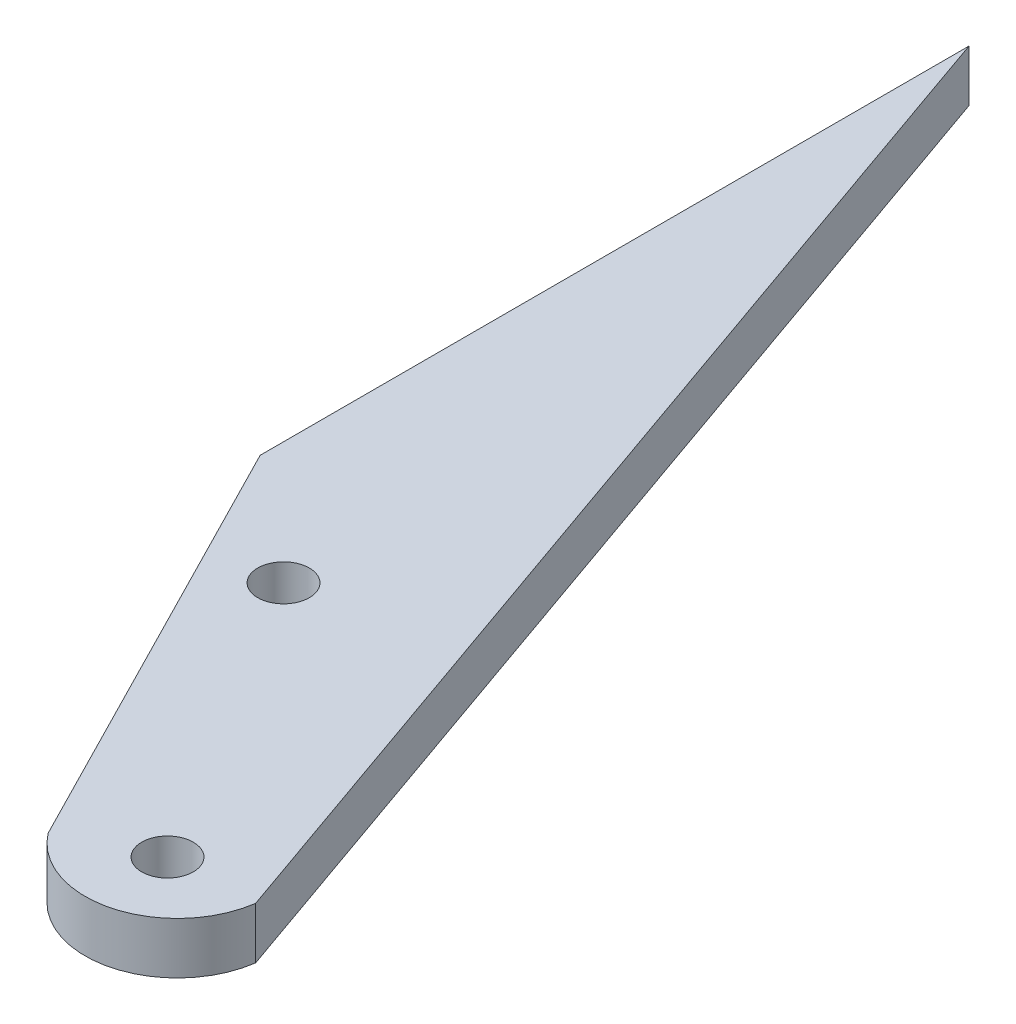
from build123d import *

# Parameters (mm, degrees)
SKETCH1_R           = 1.5
BOSS_EXTRUDE1_DEPTH = 3


with BuildPart() as part:
    # Sketch1 → Boss-Extrude1 (new body)
    with BuildSketch(Plane(origin=(0, 0, 0), x_dir=(1, 0, 0), z_dir=(0, 1, 0))):
        with BuildLine():
            Line((-22.443608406, 63.945737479), (-22.443608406, 22.705737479))
            Line((-22.443608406, 22.705737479), (-9.573677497, -2.498525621))
            ThreePointArc((-9.573677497, -2.498525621), (-3.954490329, -4.438597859), (0, 0))
            Line((0, 0), (-22.443608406, 63.945737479))
        make_face()
        with Locations(Location((-15.336480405, 16.958709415, 0), (0, 0, 270))):
            Circle(SKETCH1_R, mode=Mode.SUBTRACT)
        with Locations(Location((-4.897949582, -0.229925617, 0), (0, 0, 270))):
            Circle(SKETCH1_R, mode=Mode.SUBTRACT)
    extrude(amount=BOSS_EXTRUDE1_DEPTH)


solid = part.part
